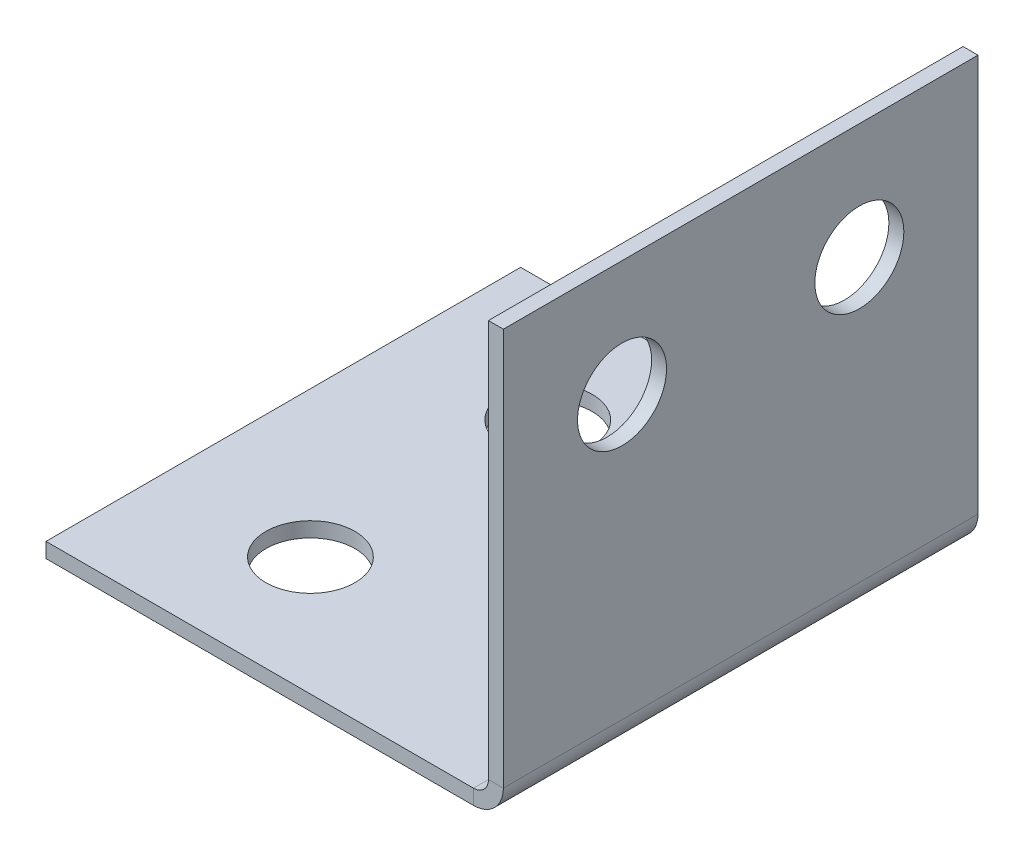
ISO-10303-21;
HEADER;
FILE_DESCRIPTION(('STEP AP214'),'2;1');
FILE_NAME('part.step','',(''),(''),'','','');
FILE_SCHEMA(('AUTOMOTIVE_DESIGN { 1 0 10303 214 1 1 1 1 }'));
ENDSEC;
DATA;
#1=APPLICATION_CONTEXT('core data for automotive mechanical design processes');
#2=APPLICATION_PROTOCOL_DEFINITION('international standard','automotive_design',2000,#1);
#3=PRODUCT_CONTEXT('',#1,'mechanical');
#4=PRODUCT('Part','Part','',(#3));
#5=PRODUCT_RELATED_PRODUCT_CATEGORY('part','',(#4));
#6=PRODUCT_DEFINITION_FORMATION('','',#4);
#7=PRODUCT_DEFINITION_CONTEXT('part definition',#1,'design');
#8=PRODUCT_DEFINITION('design','',#6,#7);
#9=PRODUCT_DEFINITION_SHAPE('','',#8);
#10=(LENGTH_UNIT() NAMED_UNIT(*) SI_UNIT(.MILLI.,.METRE.));
#11=(NAMED_UNIT(*) PLANE_ANGLE_UNIT() SI_UNIT($,.RADIAN.));
#12=(NAMED_UNIT(*) SI_UNIT($,.STERADIAN.) SOLID_ANGLE_UNIT());
#13=UNCERTAINTY_MEASURE_WITH_UNIT(LENGTH_MEASURE(1.E-05),#10,'distance_accuracy_value','');
#14=(GEOMETRIC_REPRESENTATION_CONTEXT(3) GLOBAL_UNCERTAINTY_ASSIGNED_CONTEXT((#13)) GLOBAL_UNIT_ASSIGNED_CONTEXT((#10,
#11,#12)) REPRESENTATION_CONTEXT('',''));
#15=CARTESIAN_POINT('',(0.,0.,0.));
#16=DIRECTION('',(0.,0.,1.));
#17=DIRECTION('',(1.,0.,0.));
#18=AXIS2_PLACEMENT_3D('',#15,#16,#17);
#19=CARTESIAN_POINT('',(0.,1.6002,25.4));
#20=DIRECTION('',(0.,0.,1.));
#21=DIRECTION('',(1.,0.,0.));
#22=AXIS2_PLACEMENT_3D('',#19,#20,#21);
#23=PLANE('',#22);
#24=DIRECTION('',(1.,0.,0.));
#25=VECTOR('',#24,1.);
#26=CARTESIAN_POINT('',(0.,1.6002,25.4));
#27=LINE('',#26,#25);
#28=CARTESIAN_POINT('',(0.,1.6002,25.4));
#29=VERTEX_POINT('',#28);
#30=CARTESIAN_POINT('',(1.6002,1.6002,25.4));
#31=VERTEX_POINT('',#30);
#32=EDGE_CURVE('E11',#29,#31,#27,.T.);
#33=ORIENTED_EDGE('',*,*,#32,.F.);
#34=CARTESIAN_POINT('',(-1.6002,1.6002,25.4));
#35=DIRECTION('',(0.,0.,-1.));
#36=DIRECTION('',(-1.,0.,0.));
#37=AXIS2_PLACEMENT_3D('',#34,#35,#36);
#38=CIRCLE('',#37,1.6002);
#39=CARTESIAN_POINT('',(-1.6002,0.,25.4));
#40=VERTEX_POINT('',#39);
#41=EDGE_CURVE('E146',#40,#29,#38,.F.);
#42=ORIENTED_EDGE('',*,*,#41,.F.);
#43=DIRECTION('',(0.,1.,0.));
#44=VECTOR('',#43,1.);
#45=CARTESIAN_POINT('',(-1.6002,-1.6002,25.4));
#46=LINE('',#45,#44);
#47=CARTESIAN_POINT('',(-1.6002,-1.6002,25.4));
#48=VERTEX_POINT('',#47);
#49=EDGE_CURVE('E40',#48,#40,#46,.T.);
#50=ORIENTED_EDGE('',*,*,#49,.F.);
#51=CARTESIAN_POINT('',(-1.6002,1.6002,25.4));
#52=DIRECTION('',(0.,0.,1.));
#53=DIRECTION('',(1.,0.,0.));
#54=AXIS2_PLACEMENT_3D('',#51,#52,#53);
#55=CIRCLE('',#54,3.2004);
#56=EDGE_CURVE('E157',#48,#31,#55,.T.);
#57=ORIENTED_EDGE('',*,*,#56,.T.);
#58=EDGE_LOOP('',(#33,#42,#50,#57));
#59=FACE_BOUND('',#58,.T.);
#60=ADVANCED_FACE('F32',(#59),#23,.T.);
#61=CARTESIAN_POINT('',(-1.6002,-1.6002,25.4));
#62=DIRECTION('',(0.,0.,1.));
#63=DIRECTION('',(1.,0.,0.));
#64=AXIS2_PLACEMENT_3D('',#61,#62,#63);
#65=PLANE('',#64);
#66=DIRECTION('',(0.,1.,0.));
#67=VECTOR('',#66,1.);
#68=CARTESIAN_POINT('',(0.,0.,25.4));
#69=LINE('',#68,#67);
#70=CARTESIAN_POINT('',(0.,44.1440206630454,25.4));
#71=VERTEX_POINT('',#70);
#72=EDGE_CURVE('E143',#29,#71,#69,.T.);
#73=ORIENTED_EDGE('',*,*,#72,.F.);
#74=ORIENTED_EDGE('',*,*,#32,.T.);
#75=DIRECTION('',(0.,1.,0.));
#76=VECTOR('',#75,1.);
#77=CARTESIAN_POINT('',(1.6002,0.,25.4));
#78=LINE('',#77,#76);
#79=CARTESIAN_POINT('',(1.6002,44.1440206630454,25.4));
#80=VERTEX_POINT('',#79);
#81=EDGE_CURVE('E140',#31,#80,#78,.T.);
#82=ORIENTED_EDGE('',*,*,#81,.T.);
#83=DIRECTION('',(1.,0.,0.));
#84=VECTOR('',#83,1.);
#85=CARTESIAN_POINT('',(0.,44.1440206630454,25.4));
#86=LINE('',#85,#84);
#87=EDGE_CURVE('E103',#71,#80,#86,.T.);
#88=ORIENTED_EDGE('',*,*,#87,.F.);
#89=EDGE_LOOP('',(#73,#74,#82,#88));
#90=FACE_BOUND('',#89,.T.);
#91=ADVANCED_FACE('F231',(#90),#65,.T.);
#92=CARTESIAN_POINT('',(-1.6002,0.,-25.4));
#93=DIRECTION('',(0.,0.,-1.));
#94=DIRECTION('',(-1.,0.,0.));
#95=AXIS2_PLACEMENT_3D('',#92,#93,#94);
#96=PLANE('',#95);
#97=DIRECTION('',(0.,-1.,0.));
#98=VECTOR('',#97,1.);
#99=CARTESIAN_POINT('',(-1.6002,0.,-25.4));
#100=LINE('',#99,#98);
#101=CARTESIAN_POINT('',(-1.6002,0.,-25.4));
#102=VERTEX_POINT('',#101);
#103=CARTESIAN_POINT('',(-1.6002,-1.6002,-25.4));
#104=VERTEX_POINT('',#103);
#105=EDGE_CURVE('E175',#102,#104,#100,.T.);
#106=ORIENTED_EDGE('',*,*,#105,.F.);
#107=CARTESIAN_POINT('',(-1.6002,1.6002,-25.4));
#108=DIRECTION('',(0.,0.,-1.));
#109=DIRECTION('',(-1.,0.,0.));
#110=AXIS2_PLACEMENT_3D('',#107,#108,#109);
#111=CIRCLE('',#110,1.6002);
#112=CARTESIAN_POINT('',(0.,1.6002,-25.4));
#113=VERTEX_POINT('',#112);
#114=EDGE_CURVE('E122',#102,#113,#111,.F.);
#115=ORIENTED_EDGE('',*,*,#114,.T.);
#116=DIRECTION('',(-1.,0.,0.));
#117=VECTOR('',#116,1.);
#118=CARTESIAN_POINT('',(1.6002,1.6002,-25.4));
#119=LINE('',#118,#117);
#120=CARTESIAN_POINT('',(1.6002,1.6002,-25.4));
#121=VERTEX_POINT('',#120);
#122=EDGE_CURVE('E106',#121,#113,#119,.T.);
#123=ORIENTED_EDGE('',*,*,#122,.F.);
#124=CARTESIAN_POINT('',(-1.6002,1.6002,-25.4));
#125=DIRECTION('',(0.,0.,1.));
#126=DIRECTION('',(1.,0.,0.));
#127=AXIS2_PLACEMENT_3D('',#124,#125,#126);
#128=CIRCLE('',#127,3.2004);
#129=EDGE_CURVE('E137',#104,#121,#128,.T.);
#130=ORIENTED_EDGE('',*,*,#129,.F.);
#131=EDGE_LOOP('',(#106,#115,#123,#130));
#132=FACE_BOUND('',#131,.T.);
#133=ADVANCED_FACE('F233',(#132),#96,.T.);
#134=CARTESIAN_POINT('',(1.6002,1.6002,-25.4));
#135=DIRECTION('',(0.,0.,-1.));
#136=DIRECTION('',(-1.,0.,0.));
#137=AXIS2_PLACEMENT_3D('',#134,#135,#136);
#138=PLANE('',#137);
#139=DIRECTION('',(1.,0.,0.));
#140=VECTOR('',#139,1.);
#141=CARTESIAN_POINT('',(-47.3518533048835,0.,-25.4));
#142=LINE('',#141,#140);
#143=CARTESIAN_POINT('',(-47.3518533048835,0.,-25.4));
#144=VERTEX_POINT('',#143);
#145=EDGE_CURVE('E128',#144,#102,#142,.T.);
#146=ORIENTED_EDGE('',*,*,#145,.T.);
#147=ORIENTED_EDGE('',*,*,#105,.T.);
#148=DIRECTION('',(1.,0.,0.));
#149=VECTOR('',#148,1.);
#150=CARTESIAN_POINT('',(-47.3518533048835,-1.6002,-25.4));
#151=LINE('',#150,#149);
#152=CARTESIAN_POINT('',(-47.3518533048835,-1.6002,-25.4));
#153=VERTEX_POINT('',#152);
#154=EDGE_CURVE('E134',#153,#104,#151,.T.);
#155=ORIENTED_EDGE('',*,*,#154,.F.);
#156=DIRECTION('',(0.,1.,0.));
#157=VECTOR('',#156,1.);
#158=CARTESIAN_POINT('',(-47.3518533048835,-1.6002,-25.4));
#159=LINE('',#158,#157);
#160=EDGE_CURVE('E131',#153,#144,#159,.T.);
#161=ORIENTED_EDGE('',*,*,#160,.T.);
#162=EDGE_LOOP('',(#146,#147,#155,#161));
#163=FACE_BOUND('',#162,.T.);
#164=ADVANCED_FACE('F219',(#163),#138,.T.);
#165=CARTESIAN_POINT('',(1.6002,0.,25.4));
#166=DIRECTION('',(-1.,0.,0.));
#167=DIRECTION('',(0.,0.,1.));
#168=AXIS2_PLACEMENT_3D('',#165,#166,#167);
#169=PLANE('',#168);
#170=CARTESIAN_POINT('',(1.6002,31.75,-12.7));
#171=DIRECTION('',(1.,0.,0.));
#172=DIRECTION('',(0.,0.,-1.));
#173=AXIS2_PLACEMENT_3D('',#170,#171,#172);
#174=CIRCLE('',#173,4.7625);
#175=CARTESIAN_POINT('',(1.6002,31.75,-17.4625));
#176=VERTEX_POINT('',#175);
#177=EDGE_CURVE('E185',#176,#176,#174,.T.);
#178=ORIENTED_EDGE('',*,*,#177,.F.);
#179=EDGE_LOOP('',(#178));
#180=FACE_BOUND('',#179,.T.);
#181=CARTESIAN_POINT('',(1.6002,31.75,12.7));
#182=DIRECTION('',(1.,0.,0.));
#183=DIRECTION('',(0.,0.,-1.));
#184=AXIS2_PLACEMENT_3D('',#181,#182,#183);
#185=CIRCLE('',#184,4.7625);
#186=CARTESIAN_POINT('',(1.6002,31.75,7.9375));
#187=VERTEX_POINT('',#186);
#188=EDGE_CURVE('E178',#187,#187,#185,.T.);
#189=ORIENTED_EDGE('',*,*,#188,.F.);
#190=EDGE_LOOP('',(#189));
#191=FACE_BOUND('',#190,.T.);
#192=DIRECTION('',(0.,1.,0.));
#193=VECTOR('',#192,1.);
#194=CARTESIAN_POINT('',(1.6002,0.,-25.4));
#195=LINE('',#194,#193);
#196=CARTESIAN_POINT('',(1.6002,44.1440206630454,-25.4));
#197=VERTEX_POINT('',#196);
#198=EDGE_CURVE('E111',#121,#197,#195,.T.);
#199=ORIENTED_EDGE('',*,*,#198,.T.);
#200=DIRECTION('',(0.,0.,-1.));
#201=VECTOR('',#200,1.);
#202=CARTESIAN_POINT('',(1.6002,44.1440206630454,25.4));
#203=LINE('',#202,#201);
#204=EDGE_CURVE('E96',#80,#197,#203,.T.);
#205=ORIENTED_EDGE('',*,*,#204,.F.);
#206=ORIENTED_EDGE('',*,*,#81,.F.);
#207=DIRECTION('',(0.,0.,-1.));
#208=VECTOR('',#207,1.);
#209=CARTESIAN_POINT('',(1.6002,1.6002,25.4));
#210=LINE('',#209,#208);
#211=EDGE_CURVE('E114',#31,#121,#210,.T.);
#212=ORIENTED_EDGE('',*,*,#211,.T.);
#213=EDGE_LOOP('',(#199,#205,#206,#212));
#214=FACE_BOUND('',#213,.T.);
#215=ADVANCED_FACE('F112',(#180,#191,#214),#169,.F.);
#216=CARTESIAN_POINT('',(0.,44.1440206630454,25.4));
#217=DIRECTION('',(0.,1.,0.));
#218=DIRECTION('',(0.,0.,1.));
#219=AXIS2_PLACEMENT_3D('',#216,#217,#218);
#220=PLANE('',#219);
#221=DIRECTION('',(1.,0.,0.));
#222=VECTOR('',#221,1.);
#223=CARTESIAN_POINT('',(0.,44.1440206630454,-25.4));
#224=LINE('',#223,#222);
#225=CARTESIAN_POINT('',(0.,44.1440206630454,-25.4));
#226=VERTEX_POINT('',#225);
#227=EDGE_CURVE('E100',#226,#197,#224,.T.);
#228=ORIENTED_EDGE('',*,*,#227,.F.);
#229=DIRECTION('',(0.,0.,-1.));
#230=VECTOR('',#229,1.);
#231=CARTESIAN_POINT('',(0.,44.1440206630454,25.4));
#232=LINE('',#231,#230);
#233=EDGE_CURVE('E107',#71,#226,#232,.T.);
#234=ORIENTED_EDGE('',*,*,#233,.F.);
#235=ORIENTED_EDGE('',*,*,#87,.T.);
#236=ORIENTED_EDGE('',*,*,#204,.T.);
#237=EDGE_LOOP('',(#228,#234,#235,#236));
#238=FACE_BOUND('',#237,.T.);
#239=ADVANCED_FACE('F98',(#238),#220,.T.);
#240=CARTESIAN_POINT('',(0.,0.,25.4));
#241=DIRECTION('',(-1.,0.,0.));
#242=DIRECTION('',(0.,0.,1.));
#243=AXIS2_PLACEMENT_3D('',#240,#241,#242);
#244=PLANE('',#243);
#245=CARTESIAN_POINT('',(0.,31.75,-12.7));
#246=DIRECTION('',(-1.,0.,0.));
#247=DIRECTION('',(0.,0.,1.));
#248=AXIS2_PLACEMENT_3D('',#245,#246,#247);
#249=CIRCLE('',#248,4.7625);
#250=CARTESIAN_POINT('',(0.,31.75,-7.93749999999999));
#251=VERTEX_POINT('',#250);
#252=EDGE_CURVE('E35',#251,#251,#249,.T.);
#253=ORIENTED_EDGE('',*,*,#252,.F.);
#254=EDGE_LOOP('',(#253));
#255=FACE_BOUND('',#254,.T.);
#256=CARTESIAN_POINT('',(0.,31.75,12.7));
#257=DIRECTION('',(-1.,0.,0.));
#258=DIRECTION('',(0.,0.,1.));
#259=AXIS2_PLACEMENT_3D('',#256,#257,#258);
#260=CIRCLE('',#259,4.7625);
#261=CARTESIAN_POINT('',(0.,31.75,17.4625));
#262=VERTEX_POINT('',#261);
#263=EDGE_CURVE('E116',#262,#262,#260,.T.);
#264=ORIENTED_EDGE('',*,*,#263,.F.);
#265=EDGE_LOOP('',(#264));
#266=FACE_BOUND('',#265,.T.);
#267=DIRECTION('',(0.,1.,0.));
#268=VECTOR('',#267,1.);
#269=CARTESIAN_POINT('',(0.,0.,-25.4));
#270=LINE('',#269,#268);
#271=EDGE_CURVE('E120',#113,#226,#270,.T.);
#272=ORIENTED_EDGE('',*,*,#271,.F.);
#273=DIRECTION('',(0.,0.,-1.));
#274=VECTOR('',#273,1.);
#275=CARTESIAN_POINT('',(0.,1.6002,25.4));
#276=LINE('',#275,#274);
#277=EDGE_CURVE('E170',#29,#113,#276,.T.);
#278=ORIENTED_EDGE('',*,*,#277,.F.);
#279=ORIENTED_EDGE('',*,*,#72,.T.);
#280=ORIENTED_EDGE('',*,*,#233,.T.);
#281=EDGE_LOOP('',(#272,#278,#279,#280));
#282=FACE_BOUND('',#281,.T.);
#283=ADVANCED_FACE('F230',(#255,#266,#282),#244,.T.);
#284=CARTESIAN_POINT('',(-1.6002,1.6002,25.4));
#285=DIRECTION('',(0.,0.,-1.));
#286=DIRECTION('',(-1.,0.,0.));
#287=AXIS2_PLACEMENT_3D('',#284,#285,#286);
#288=CYLINDRICAL_SURFACE('',#287,1.6002);
#289=ORIENTED_EDGE('',*,*,#114,.F.);
#290=DIRECTION('',(0.,0.,-1.));
#291=VECTOR('',#290,1.);
#292=CARTESIAN_POINT('',(-1.6002,0.,25.4));
#293=LINE('',#292,#291);
#294=EDGE_CURVE('E167',#40,#102,#293,.T.);
#295=ORIENTED_EDGE('',*,*,#294,.F.);
#296=ORIENTED_EDGE('',*,*,#41,.T.);
#297=ORIENTED_EDGE('',*,*,#277,.T.);
#298=EDGE_LOOP('',(#289,#295,#296,#297));
#299=FACE_BOUND('',#298,.T.);
#300=ADVANCED_FACE('F208',(#299),#288,.F.);
#301=CARTESIAN_POINT('',(-47.3518533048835,0.,25.4));
#302=DIRECTION('',(0.,1.,0.));
#303=DIRECTION('',(0.,0.,1.));
#304=AXIS2_PLACEMENT_3D('',#301,#302,#303);
#305=PLANE('',#304);
#306=CARTESIAN_POINT('',(-31.75,0.,12.7));
#307=DIRECTION('',(0.,1.,0.));
#308=DIRECTION('',(0.,0.,1.));
#309=AXIS2_PLACEMENT_3D('',#306,#307,#308);
#310=CIRCLE('',#309,4.7625);
#311=CARTESIAN_POINT('',(-31.75,0.,17.4625));
#312=VERTEX_POINT('',#311);
#313=EDGE_CURVE('E198',#312,#312,#310,.T.);
#314=ORIENTED_EDGE('',*,*,#313,.F.);
#315=EDGE_LOOP('',(#314));
#316=FACE_BOUND('',#315,.T.);
#317=CARTESIAN_POINT('',(-31.75,0.,-12.7));
#318=DIRECTION('',(0.,1.,0.));
#319=DIRECTION('',(0.,0.,1.));
#320=AXIS2_PLACEMENT_3D('',#317,#318,#319);
#321=CIRCLE('',#320,4.7625);
#322=CARTESIAN_POINT('',(-31.75,0.,-7.9375));
#323=VERTEX_POINT('',#322);
#324=EDGE_CURVE('E192',#323,#323,#321,.T.);
#325=ORIENTED_EDGE('',*,*,#324,.F.);
#326=EDGE_LOOP('',(#325));
#327=FACE_BOUND('',#326,.T.);
#328=ORIENTED_EDGE('',*,*,#145,.F.);
#329=DIRECTION('',(0.,0.,-1.));
#330=VECTOR('',#329,1.);
#331=CARTESIAN_POINT('',(-47.3518533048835,0.,25.4));
#332=LINE('',#331,#330);
#333=CARTESIAN_POINT('',(-47.3518533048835,0.,25.4));
#334=VERTEX_POINT('',#333);
#335=EDGE_CURVE('E165',#334,#144,#332,.T.);
#336=ORIENTED_EDGE('',*,*,#335,.F.);
#337=DIRECTION('',(1.,0.,0.));
#338=VECTOR('',#337,1.);
#339=CARTESIAN_POINT('',(-47.3518533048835,0.,25.4));
#340=LINE('',#339,#338);
#341=EDGE_CURVE('E149',#334,#40,#340,.T.);
#342=ORIENTED_EDGE('',*,*,#341,.T.);
#343=ORIENTED_EDGE('',*,*,#294,.T.);
#344=EDGE_LOOP('',(#328,#336,#342,#343));
#345=FACE_BOUND('',#344,.T.);
#346=ADVANCED_FACE('F204',(#316,#327,#345),#305,.T.);
#347=CARTESIAN_POINT('',(-47.3518533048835,-1.6002,25.4));
#348=DIRECTION('',(-1.,0.,0.));
#349=DIRECTION('',(0.,0.,1.));
#350=AXIS2_PLACEMENT_3D('',#347,#348,#349);
#351=PLANE('',#350);
#352=ORIENTED_EDGE('',*,*,#160,.F.);
#353=DIRECTION('',(0.,0.,-1.));
#354=VECTOR('',#353,1.);
#355=CARTESIAN_POINT('',(-47.3518533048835,-1.6002,25.4));
#356=LINE('',#355,#354);
#357=CARTESIAN_POINT('',(-47.3518533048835,-1.6002,25.4));
#358=VERTEX_POINT('',#357);
#359=EDGE_CURVE('E163',#358,#153,#356,.T.);
#360=ORIENTED_EDGE('',*,*,#359,.F.);
#361=DIRECTION('',(0.,1.,0.));
#362=VECTOR('',#361,1.);
#363=CARTESIAN_POINT('',(-47.3518533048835,-1.6002,25.4));
#364=LINE('',#363,#362);
#365=EDGE_CURVE('E152',#358,#334,#364,.T.);
#366=ORIENTED_EDGE('',*,*,#365,.T.);
#367=ORIENTED_EDGE('',*,*,#335,.T.);
#368=EDGE_LOOP('',(#352,#360,#366,#367));
#369=FACE_BOUND('',#368,.T.);
#370=ADVANCED_FACE('F207',(#369),#351,.T.);
#371=CARTESIAN_POINT('',(-47.3518533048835,-1.6002,25.4));
#372=DIRECTION('',(0.,1.,0.));
#373=DIRECTION('',(0.,0.,1.));
#374=AXIS2_PLACEMENT_3D('',#371,#372,#373);
#375=PLANE('',#374);
#376=CARTESIAN_POINT('',(-31.75,-1.6002,12.7));
#377=DIRECTION('',(0.,1.,0.));
#378=DIRECTION('',(0.,0.,1.));
#379=AXIS2_PLACEMENT_3D('',#376,#377,#378);
#380=CIRCLE('',#379,4.7625);
#381=CARTESIAN_POINT('',(-31.75,-1.6002,17.4625));
#382=VERTEX_POINT('',#381);
#383=EDGE_CURVE('E195',#382,#382,#380,.T.);
#384=ORIENTED_EDGE('',*,*,#383,.T.);
#385=EDGE_LOOP('',(#384));
#386=FACE_BOUND('',#385,.T.);
#387=CARTESIAN_POINT('',(-31.75,-1.6002,-12.7));
#388=DIRECTION('',(0.,1.,0.));
#389=DIRECTION('',(0.,0.,1.));
#390=AXIS2_PLACEMENT_3D('',#387,#388,#389);
#391=CIRCLE('',#390,4.7625);
#392=CARTESIAN_POINT('',(-31.75,-1.6002,-7.9375));
#393=VERTEX_POINT('',#392);
#394=EDGE_CURVE('E189',#393,#393,#391,.T.);
#395=ORIENTED_EDGE('',*,*,#394,.T.);
#396=EDGE_LOOP('',(#395));
#397=FACE_BOUND('',#396,.T.);
#398=ORIENTED_EDGE('',*,*,#154,.T.);
#399=DIRECTION('',(0.,0.,-1.));
#400=VECTOR('',#399,1.);
#401=CARTESIAN_POINT('',(-1.6002,-1.6002,25.4));
#402=LINE('',#401,#400);
#403=EDGE_CURVE('E160',#48,#104,#402,.T.);
#404=ORIENTED_EDGE('',*,*,#403,.F.);
#405=DIRECTION('',(1.,0.,0.));
#406=VECTOR('',#405,1.);
#407=CARTESIAN_POINT('',(-47.3518533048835,-1.6002,25.4));
#408=LINE('',#407,#406);
#409=EDGE_CURVE('E155',#358,#48,#408,.T.);
#410=ORIENTED_EDGE('',*,*,#409,.F.);
#411=ORIENTED_EDGE('',*,*,#359,.T.);
#412=EDGE_LOOP('',(#398,#404,#410,#411));
#413=FACE_BOUND('',#412,.T.);
#414=ADVANCED_FACE('F255',(#386,#397,#413),#375,.F.);
#415=CARTESIAN_POINT('',(-1.6002,1.6002,25.4));
#416=DIRECTION('',(0.,0.,-1.));
#417=DIRECTION('',(-1.,0.,0.));
#418=AXIS2_PLACEMENT_3D('',#415,#416,#417);
#419=CYLINDRICAL_SURFACE('',#418,3.2004);
#420=ORIENTED_EDGE('',*,*,#129,.T.);
#421=ORIENTED_EDGE('',*,*,#211,.F.);
#422=ORIENTED_EDGE('',*,*,#56,.F.);
#423=ORIENTED_EDGE('',*,*,#403,.T.);
#424=EDGE_LOOP('',(#420,#421,#422,#423));
#425=FACE_BOUND('',#424,.T.);
#426=ADVANCED_FACE('F258',(#425),#419,.T.);
#427=CARTESIAN_POINT('',(-1.6002,1.6002,25.4));
#428=DIRECTION('',(0.,0.,-1.));
#429=DIRECTION('',(-1.,0.,0.));
#430=AXIS2_PLACEMENT_3D('',#427,#428,#429);
#431=PLANE('',#430);
#432=ORIENTED_EDGE('',*,*,#409,.T.);
#433=ORIENTED_EDGE('',*,*,#49,.T.);
#434=ORIENTED_EDGE('',*,*,#341,.F.);
#435=ORIENTED_EDGE('',*,*,#365,.F.);
#436=EDGE_LOOP('',(#432,#433,#434,#435));
#437=FACE_BOUND('',#436,.T.);
#438=ADVANCED_FACE('F224',(#437),#431,.F.);
#439=CARTESIAN_POINT('',(-1.6002,1.6002,-25.4));
#440=DIRECTION('',(0.,0.,-1.));
#441=DIRECTION('',(-1.,0.,0.));
#442=AXIS2_PLACEMENT_3D('',#439,#440,#441);
#443=PLANE('',#442);
#444=ORIENTED_EDGE('',*,*,#198,.F.);
#445=ORIENTED_EDGE('',*,*,#122,.T.);
#446=ORIENTED_EDGE('',*,*,#271,.T.);
#447=ORIENTED_EDGE('',*,*,#227,.T.);
#448=EDGE_LOOP('',(#444,#445,#446,#447));
#449=FACE_BOUND('',#448,.T.);
#450=ADVANCED_FACE('F118',(#449),#443,.T.);
#451=CARTESIAN_POINT('',(-47.3518533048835,31.75,12.7));
#452=DIRECTION('',(1.,0.,0.));
#453=DIRECTION('',(0.,0.,-1.));
#454=AXIS2_PLACEMENT_3D('',#451,#452,#453);
#455=CYLINDRICAL_SURFACE('',#454,4.7625);
#456=ORIENTED_EDGE('',*,*,#263,.T.);
#457=EDGE_LOOP('',(#456));
#458=FACE_BOUND('',#457,.T.);
#459=ORIENTED_EDGE('',*,*,#188,.T.);
#460=EDGE_LOOP('',(#459));
#461=FACE_BOUND('',#460,.T.);
#462=ADVANCED_FACE('F267',(#458,#461),#455,.F.);
#463=CARTESIAN_POINT('',(-47.3518533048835,31.75,-12.7));
#464=DIRECTION('',(1.,0.,0.));
#465=DIRECTION('',(0.,0.,-1.));
#466=AXIS2_PLACEMENT_3D('',#463,#464,#465);
#467=CYLINDRICAL_SURFACE('',#466,4.7625);
#468=ORIENTED_EDGE('',*,*,#252,.T.);
#469=EDGE_LOOP('',(#468));
#470=FACE_BOUND('',#469,.T.);
#471=ORIENTED_EDGE('',*,*,#177,.T.);
#472=EDGE_LOOP('',(#471));
#473=FACE_BOUND('',#472,.T.);
#474=ADVANCED_FACE('F270',(#470,#473),#467,.F.);
#475=CARTESIAN_POINT('',(-31.75,-1.6002,-12.7));
#476=DIRECTION('',(0.,1.,0.));
#477=DIRECTION('',(0.,0.,1.));
#478=AXIS2_PLACEMENT_3D('',#475,#476,#477);
#479=CYLINDRICAL_SURFACE('',#478,4.7625);
#480=ORIENTED_EDGE('',*,*,#394,.F.);
#481=EDGE_LOOP('',(#480));
#482=FACE_BOUND('',#481,.T.);
#483=ORIENTED_EDGE('',*,*,#324,.T.);
#484=EDGE_LOOP('',(#483));
#485=FACE_BOUND('',#484,.T.);
#486=ADVANCED_FACE('F273',(#482,#485),#479,.F.);
#487=CARTESIAN_POINT('',(-31.75,-1.6002,12.7));
#488=DIRECTION('',(0.,1.,0.));
#489=DIRECTION('',(0.,0.,1.));
#490=AXIS2_PLACEMENT_3D('',#487,#488,#489);
#491=CYLINDRICAL_SURFACE('',#490,4.7625);
#492=ORIENTED_EDGE('',*,*,#383,.F.);
#493=EDGE_LOOP('',(#492));
#494=FACE_BOUND('',#493,.T.);
#495=ORIENTED_EDGE('',*,*,#313,.T.);
#496=EDGE_LOOP('',(#495));
#497=FACE_BOUND('',#496,.T.);
#498=ADVANCED_FACE('F202',(#494,#497),#491,.F.);
#499=CLOSED_SHELL('',(#60,#91,#133,#164,#215,#239,#283,#300,#346,#370,#414,#426,#438,#450,#462,
#474,#486,#498));
#500=MANIFOLD_SOLID_BREP('B2',#499);
#501=ADVANCED_BREP_SHAPE_REPRESENTATION('',(#18,#500),#14);
#502=SHAPE_DEFINITION_REPRESENTATION(#9,#501);
ENDSEC;
END-ISO-10303-21;
